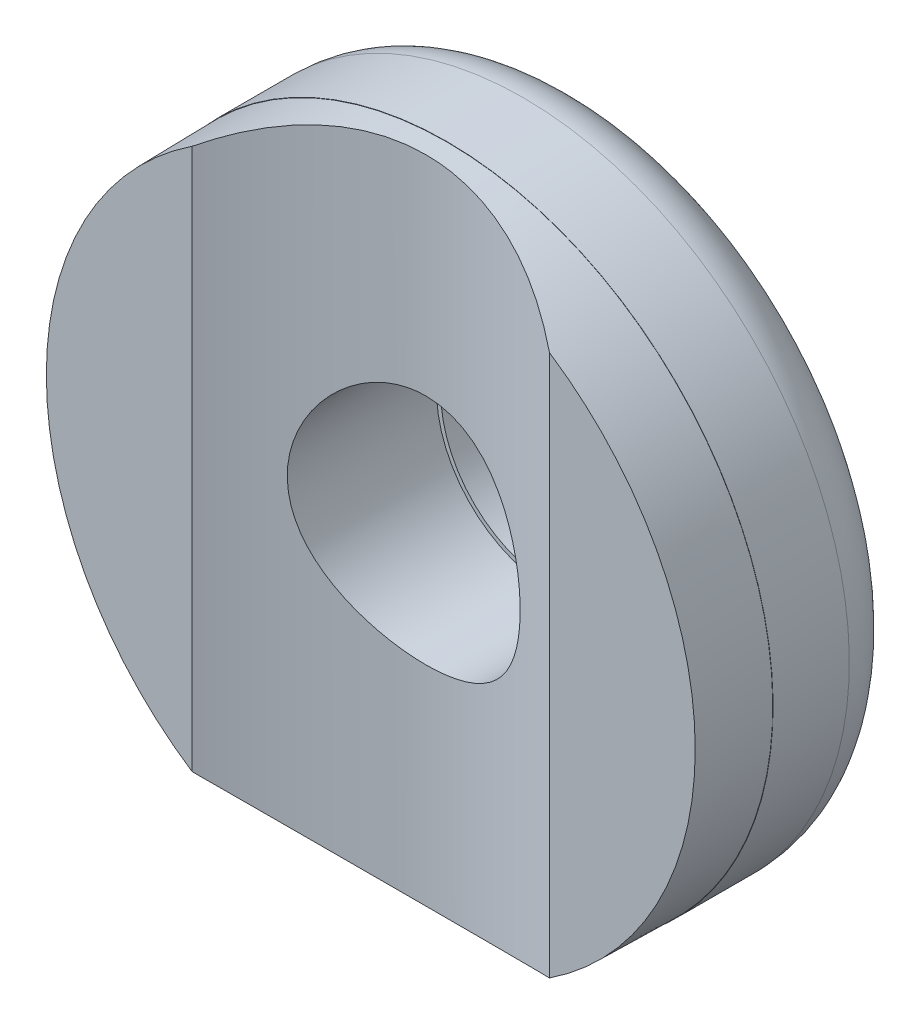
ISO-10303-21;
HEADER;
FILE_DESCRIPTION(('STEP AP214'),'2;1');
FILE_NAME('part.step','',(''),(''),'','','');
FILE_SCHEMA(('AUTOMOTIVE_DESIGN { 1 0 10303 214 1 1 1 1 }'));
ENDSEC;
DATA;
#1=APPLICATION_CONTEXT('core data for automotive mechanical design processes');
#2=APPLICATION_PROTOCOL_DEFINITION('international standard','automotive_design',2000,#1);
#3=PRODUCT_CONTEXT('',#1,'mechanical');
#4=PRODUCT('Part','Part','',(#3));
#5=PRODUCT_RELATED_PRODUCT_CATEGORY('part','',(#4));
#6=PRODUCT_DEFINITION_FORMATION('','',#4);
#7=PRODUCT_DEFINITION_CONTEXT('part definition',#1,'design');
#8=PRODUCT_DEFINITION('design','',#6,#7);
#9=PRODUCT_DEFINITION_SHAPE('','',#8);
#10=(LENGTH_UNIT() NAMED_UNIT(*) SI_UNIT(.MILLI.,.METRE.));
#11=(NAMED_UNIT(*) PLANE_ANGLE_UNIT() SI_UNIT($,.RADIAN.));
#12=(NAMED_UNIT(*) SI_UNIT($,.STERADIAN.) SOLID_ANGLE_UNIT());
#13=UNCERTAINTY_MEASURE_WITH_UNIT(LENGTH_MEASURE(1.E-05),#10,'distance_accuracy_value','');
#14=(GEOMETRIC_REPRESENTATION_CONTEXT(3) GLOBAL_UNCERTAINTY_ASSIGNED_CONTEXT((#13)) GLOBAL_UNIT_ASSIGNED_CONTEXT((#10,
#11,#12)) REPRESENTATION_CONTEXT('',''));
#15=CARTESIAN_POINT('',(0.,0.,0.));
#16=DIRECTION('',(0.,0.,1.));
#17=DIRECTION('',(1.,0.,0.));
#18=AXIS2_PLACEMENT_3D('',#15,#16,#17);
#19=CARTESIAN_POINT('',(6.3,0.,0.));
#20=DIRECTION('',(0.,0.,1.));
#21=DIRECTION('',(0.,-1.,0.));
#22=AXIS2_PLACEMENT_3D('',#19,#20,#21);
#23=PLANE('',#22);
#24=CARTESIAN_POINT('',(0.,0.,0.));
#25=DIRECTION('',(0.,0.,1.));
#26=DIRECTION('',(1.,0.,0.));
#27=AXIS2_PLACEMENT_3D('',#24,#25,#26);
#28=CIRCLE('',#27,2.65);
#29=CARTESIAN_POINT('',(2.65,0.,0.));
#30=VERTEX_POINT('',#29);
#31=EDGE_CURVE('E86',#30,#30,#28,.T.);
#32=ORIENTED_EDGE('',*,*,#31,.T.);
#33=EDGE_LOOP('',(#32));
#34=FACE_BOUND('',#33,.T.);
#35=CARTESIAN_POINT('',(0.,0.,0.));
#36=DIRECTION('',(0.,0.,-1.));
#37=DIRECTION('',(0.,1.,0.));
#38=AXIS2_PLACEMENT_3D('',#35,#36,#37);
#39=CIRCLE('',#38,6.3);
#40=CARTESIAN_POINT('',(0.,6.3,0.));
#41=VERTEX_POINT('',#40);
#42=EDGE_CURVE('E93',#41,#41,#39,.T.);
#43=ORIENTED_EDGE('',*,*,#42,.T.);
#44=EDGE_LOOP('',(#43));
#45=FACE_BOUND('',#44,.T.);
#46=ADVANCED_FACE('F14',(#34,#45),#23,.F.);
#47=CARTESIAN_POINT('',(0.,0.,1.4));
#48=DIRECTION('',(0.,0.,-1.));
#49=DIRECTION('',(0.,1.,0.));
#50=AXIS2_PLACEMENT_3D('',#47,#48,#49);
#51=TOROIDAL_SURFACE('',#50,6.3,1.4);
#52=CARTESIAN_POINT('',(0.,0.,1.4));
#53=DIRECTION('',(0.,0.,-1.));
#54=DIRECTION('',(0.,1.,0.));
#55=AXIS2_PLACEMENT_3D('',#52,#53,#54);
#56=CIRCLE('',#55,7.7);
#57=CARTESIAN_POINT('',(0.,7.7,1.4));
#58=VERTEX_POINT('',#57);
#59=EDGE_CURVE('E95',#58,#58,#56,.T.);
#60=ORIENTED_EDGE('',*,*,#59,.T.);
#61=EDGE_LOOP('',(#60));
#62=FACE_BOUND('',#61,.T.);
#63=ORIENTED_EDGE('',*,*,#42,.F.);
#64=EDGE_LOOP('',(#63));
#65=FACE_BOUND('',#64,.T.);
#66=ADVANCED_FACE('F131',(#62,#65),#51,.T.);
#67=CARTESIAN_POINT('',(0.,0.,0.));
#68=DIRECTION('',(0.,0.,-1.));
#69=DIRECTION('',(0.,1.,0.));
#70=AXIS2_PLACEMENT_3D('',#67,#68,#69);
#71=CYLINDRICAL_SURFACE('',#70,7.7);
#72=ORIENTED_EDGE('',*,*,#59,.F.);
#73=EDGE_LOOP('',(#72));
#74=FACE_BOUND('',#73,.T.);
#75=CARTESIAN_POINT('',(0.,0.,3.2));
#76=DIRECTION('',(0.,0.,-1.));
#77=DIRECTION('',(0.,1.,0.));
#78=AXIS2_PLACEMENT_3D('',#75,#76,#77);
#79=CIRCLE('',#78,7.7);
#80=CARTESIAN_POINT('',(0.,7.7,3.2));
#81=VERTEX_POINT('',#80);
#82=EDGE_CURVE('E18',#81,#81,#79,.T.);
#83=ORIENTED_EDGE('',*,*,#82,.T.);
#84=EDGE_LOOP('',(#83));
#85=FACE_BOUND('',#84,.T.);
#86=ADVANCED_FACE('F102',(#74,#85),#71,.T.);
#87=CARTESIAN_POINT('',(7.,0.,3.2));
#88=DIRECTION('',(0.,0.,-1.));
#89=DIRECTION('',(0.,1.,0.));
#90=AXIS2_PLACEMENT_3D('',#87,#88,#89);
#91=PLANE('',#90);
#92=ORIENTED_EDGE('',*,*,#82,.F.);
#93=EDGE_LOOP('',(#92));
#94=FACE_BOUND('',#93,.T.);
#95=CARTESIAN_POINT('',(0.,0.,3.2));
#96=DIRECTION('',(0.,0.,-1.));
#97=DIRECTION('',(0.,1.,0.));
#98=AXIS2_PLACEMENT_3D('',#95,#96,#97);
#99=CIRCLE('',#98,7.69301797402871);
#100=CARTESIAN_POINT('',(0.,7.69301797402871,3.2));
#101=VERTEX_POINT('',#100);
#102=EDGE_CURVE('E9',#101,#101,#99,.T.);
#103=ORIENTED_EDGE('',*,*,#102,.T.);
#104=EDGE_LOOP('',(#103));
#105=FACE_BOUND('',#104,.T.);
#106=ADVANCED_FACE('F104',(#94,#105),#91,.F.);
#107=CARTESIAN_POINT('',(0.,0.,3.2));
#108=DIRECTION('',(0.,0.,-1.));
#109=DIRECTION('',(0.,1.,0.));
#110=AXIS2_PLACEMENT_3D('',#107,#108,#109);
#111=CYLINDRICAL_SURFACE('',#110,2.65);
#112=ORIENTED_EDGE('',*,*,#31,.F.);
#113=EDGE_LOOP('',(#112));
#114=FACE_BOUND('',#113,.T.);
#115=CARTESIAN_POINT('',(0.,0.,0.7));
#116=DIRECTION('',(0.,0.,-1.));
#117=DIRECTION('',(0.,1.,0.));
#118=AXIS2_PLACEMENT_3D('',#115,#116,#117);
#119=CIRCLE('',#118,2.65);
#120=CARTESIAN_POINT('',(0.,2.65,0.7));
#121=VERTEX_POINT('',#120);
#122=EDGE_CURVE('E89',#121,#121,#119,.F.);
#123=ORIENTED_EDGE('',*,*,#122,.T.);
#124=EDGE_LOOP('',(#123));
#125=FACE_BOUND('',#124,.T.);
#126=ADVANCED_FACE('F107',(#114,#125),#111,.F.);
#127=CARTESIAN_POINT('',(0.,0.,0.7));
#128=DIRECTION('',(0.,0.,-1.));
#129=DIRECTION('',(0.,1.,0.));
#130=AXIS2_PLACEMENT_3D('',#127,#128,#129);
#131=PLANE('',#130);
#132=CARTESIAN_POINT('',(0.,0.,0.7));
#133=DIRECTION('',(0.,0.,-1.));
#134=DIRECTION('',(0.,1.,0.));
#135=AXIS2_PLACEMENT_3D('',#132,#133,#134);
#136=CIRCLE('',#135,2.75);
#137=CARTESIAN_POINT('',(0.,2.75,0.7));
#138=VERTEX_POINT('',#137);
#139=EDGE_CURVE('E90',#138,#138,#136,.F.);
#140=ORIENTED_EDGE('',*,*,#139,.T.);
#141=EDGE_LOOP('',(#140));
#142=FACE_BOUND('',#141,.T.);
#143=ORIENTED_EDGE('',*,*,#122,.F.);
#144=EDGE_LOOP('',(#143));
#145=FACE_BOUND('',#144,.T.);
#146=ADVANCED_FACE('F16',(#142,#145),#131,.F.);
#147=CARTESIAN_POINT('',(0.,0.,5.));
#148=DIRECTION('',(0.,0.,-1.));
#149=DIRECTION('',(0.,1.,0.));
#150=AXIS2_PLACEMENT_3D('',#147,#148,#149);
#151=PLANE('',#150);
#152=CARTESIAN_POINT('',(0.,0.,5.));
#153=DIRECTION('',(0.,0.,-1.));
#154=DIRECTION('',(0.,1.,0.));
#155=AXIS2_PLACEMENT_3D('',#152,#153,#154);
#156=CIRCLE('',#155,7.66159885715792);
#157=CARTESIAN_POINT('',(4.22018956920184,6.39453649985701,5.));
#158=VERTEX_POINT('',#157);
#159=CARTESIAN_POINT('',(4.22018956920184,-6.39453649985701,5.));
#160=VERTEX_POINT('',#159);
#161=EDGE_CURVE('E48',#158,#160,#156,.T.);
#162=ORIENTED_EDGE('',*,*,#161,.F.);
#163=DIRECTION('',(0.,1.,0.));
#164=VECTOR('',#163,1.);
#165=CARTESIAN_POINT('',(4.22018956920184,-7.7,5.));
#166=LINE('',#165,#164);
#167=EDGE_CURVE('E31',#160,#158,#166,.T.);
#168=ORIENTED_EDGE('',*,*,#167,.F.);
#169=EDGE_LOOP('',(#162,#168));
#170=FACE_BOUND('',#169,.T.);
#171=ADVANCED_FACE('F116',(#170),#151,.F.);
#172=DIRECTION('',(0.,1.,0.));
#173=VECTOR('',#172,1.);
#174=CARTESIAN_POINT('',(-4.22018956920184,-7.7,5.));
#175=LINE('',#174,#173);
#176=CARTESIAN_POINT('',(-4.22018956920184,6.39453649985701,5.));
#177=VERTEX_POINT('',#176);
#178=CARTESIAN_POINT('',(-4.22018956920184,-6.39453649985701,5.));
#179=VERTEX_POINT('',#178);
#180=EDGE_CURVE('E36',#177,#179,#175,.F.);
#181=ORIENTED_EDGE('',*,*,#180,.F.);
#182=EDGE_CURVE('E53',#179,#177,#156,.T.);
#183=ORIENTED_EDGE('',*,*,#182,.F.);
#184=EDGE_LOOP('',(#181,#183));
#185=FACE_BOUND('',#184,.T.);
#186=ADVANCED_FACE('F52',(#185),#151,.F.);
#187=CARTESIAN_POINT('',(0.,-7.7,11.2));
#188=DIRECTION('',(0.,1.,0.));
#189=DIRECTION('',(-1.,0.,0.));
#190=AXIS2_PLACEMENT_3D('',#187,#188,#189);
#191=CYLINDRICAL_SURFACE('',#190,7.5);
#192=CARTESIAN_POINT('',(-4.22048337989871,-6.39433840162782,5.0002000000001));
#193=CARTESIAN_POINT('',(-4.09185215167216,-6.48107504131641,4.91263113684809));
#194=CARTESIAN_POINT('',(-3.95906178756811,-6.56483854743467,4.82809791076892));
#195=CARTESIAN_POINT('',(-3.68522126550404,-6.72561223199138,4.66589819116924));
#196=CARTESIAN_POINT('',(-3.54416269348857,-6.80261532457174,4.58823890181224));
#197=CARTESIAN_POINT('',(-3.25292487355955,-6.94947612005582,4.44016424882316));
#198=CARTESIAN_POINT('',(-3.10268043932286,-7.01927019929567,4.36981335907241));
#199=CARTESIAN_POINT('',(-2.79460166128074,-7.14998264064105,4.2380851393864));
#200=CARTESIAN_POINT('',(-2.6367687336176,-7.21090265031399,4.17670614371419));
#201=CARTESIAN_POINT('',(-2.31305444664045,-7.32326223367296,4.06351801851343));
#202=CARTESIAN_POINT('',(-2.14712515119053,-7.3746336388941,4.01177769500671));
#203=CARTESIAN_POINT('',(-1.80931755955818,-7.46635465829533,3.91940890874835));
#204=CARTESIAN_POINT('',(-1.63744268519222,-7.50671049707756,3.878774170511));
#205=CARTESIAN_POINT('',(-1.28956623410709,-7.57543845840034,3.80957673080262));
#206=CARTESIAN_POINT('',(-1.11358133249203,-7.60385230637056,3.78097199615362));
#207=CARTESIAN_POINT('',(-0.758482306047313,-7.64822092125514,3.73630722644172));
#208=CARTESIAN_POINT('',(-0.579368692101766,-7.66417770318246,3.72024516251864));
#209=CARTESIAN_POINT('',(-0.240292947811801,-7.68215197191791,3.7021524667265));
#210=CARTESIAN_POINT('',(-0.0804757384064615,-7.68555136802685,3.69873078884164));
#211=CARTESIAN_POINT('',(0.238941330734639,-7.6821979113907,3.70210627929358));
#212=CARTESIAN_POINT('',(0.398541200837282,-7.67544556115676,3.70890294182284));
#213=CARTESIAN_POINT('',(0.716337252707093,-7.65191772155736,3.73258623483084));
#214=CARTESIAN_POINT('',(0.874532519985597,-7.63513612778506,3.74947901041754));
#215=CARTESIAN_POINT('',(1.18821873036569,-7.59187550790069,3.79302936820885));
#216=CARTESIAN_POINT('',(1.34370969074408,-7.56539654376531,3.81968688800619));
#217=CARTESIAN_POINT('',(1.64273552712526,-7.50488563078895,3.88061192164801));
#218=CARTESIAN_POINT('',(1.7864659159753,-7.47133151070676,3.91439806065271));
#219=CARTESIAN_POINT('',(2.06982106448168,-7.3964830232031,3.98977320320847));
#220=CARTESIAN_POINT('',(2.20944437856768,-7.35518596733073,4.03136491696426));
#221=CARTESIAN_POINT('',(2.62129166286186,-7.22047149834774,4.16706053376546));
#222=CARTESIAN_POINT('',(2.88653113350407,-7.11622285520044,4.272092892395));
#223=CARTESIAN_POINT('',(3.33421729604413,-6.91145621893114,4.47849056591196));
#224=CARTESIAN_POINT('',(3.52138773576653,-6.81590950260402,4.57482550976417));
#225=CARTESIAN_POINT('',(3.88146350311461,-6.61330758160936,4.77918679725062));
#226=CARTESIAN_POINT('',(4.05442327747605,-6.50630030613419,4.88716446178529));
#227=CARTESIAN_POINT('',(4.22048337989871,-6.39433840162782,5.0002000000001));
#228=B_SPLINE_CURVE_WITH_KNOTS('',3,(#192,#193,#194,#195,#196,#197,#198,#199,#200,#201,#202,
#203,#204,#205,#206,#207,#208,#209,#210,#211,#212,#213,#214,#215,#216,#217,#218,#219,#220,#221,
#222,#223,#224,#225,#226,#227),.UNSPECIFIED.,.F.,.F.,(4,2,2,2,2,2,2,2,2,2,2,2,2,2,2,2,2,4),(0.,
0.534446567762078,1.06944678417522,1.60882469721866,2.14810234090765,2.69109332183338,
3.23377683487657,3.77454811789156,4.31523190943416,4.79426704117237,5.27327846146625,
5.75258173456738,6.23188194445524,6.68563402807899,7.13954395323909,8.04724566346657,
8.73982407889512,9.42961150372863),.UNSPECIFIED.);
#229=EDGE_CURVE('E23',#179,#160,#228,.T.);
#230=ORIENTED_EDGE('',*,*,#229,.T.);
#231=ORIENTED_EDGE('',*,*,#167,.T.);
#232=CARTESIAN_POINT('',(4.22048337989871,6.39433840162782,5.0002000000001));
#233=CARTESIAN_POINT('',(4.09185215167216,6.48107504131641,4.91263113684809));
#234=CARTESIAN_POINT('',(3.95906178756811,6.56483854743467,4.82809791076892));
#235=CARTESIAN_POINT('',(3.68522126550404,6.72561223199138,4.66589819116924));
#236=CARTESIAN_POINT('',(3.54416269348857,6.80261532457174,4.58823890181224));
#237=CARTESIAN_POINT('',(3.25292487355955,6.94947612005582,4.44016424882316));
#238=CARTESIAN_POINT('',(3.10268043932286,7.01927019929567,4.36981335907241));
#239=CARTESIAN_POINT('',(2.79460166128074,7.14998264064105,4.2380851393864));
#240=CARTESIAN_POINT('',(2.6367687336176,7.21090265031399,4.17670614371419));
#241=CARTESIAN_POINT('',(2.31305444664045,7.32326223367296,4.06351801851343));
#242=CARTESIAN_POINT('',(2.14712515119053,7.3746336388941,4.01177769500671));
#243=CARTESIAN_POINT('',(1.80931755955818,7.46635465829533,3.91940890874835));
#244=CARTESIAN_POINT('',(1.63744268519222,7.50671049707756,3.878774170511));
#245=CARTESIAN_POINT('',(1.28956623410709,7.57543845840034,3.80957673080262));
#246=CARTESIAN_POINT('',(1.11358133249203,7.60385230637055,3.78097199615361));
#247=CARTESIAN_POINT('',(0.758482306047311,7.64822092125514,3.73630722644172));
#248=CARTESIAN_POINT('',(0.579368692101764,7.66417770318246,3.72024516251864));
#249=CARTESIAN_POINT('',(0.240292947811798,7.68215197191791,3.7021524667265));
#250=CARTESIAN_POINT('',(0.0804757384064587,7.68555136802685,3.69873078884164));
#251=CARTESIAN_POINT('',(-0.238941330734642,7.6821979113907,3.70210627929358));
#252=CARTESIAN_POINT('',(-0.398541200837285,7.67544556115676,3.70890294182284));
#253=CARTESIAN_POINT('',(-0.716337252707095,7.65191772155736,3.73258623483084));
#254=CARTESIAN_POINT('',(-0.874532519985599,7.63513612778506,3.74947901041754));
#255=CARTESIAN_POINT('',(-1.1882187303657,7.59187550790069,3.79302936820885));
#256=CARTESIAN_POINT('',(-1.34370969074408,7.56539654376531,3.81968688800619));
#257=CARTESIAN_POINT('',(-1.64273552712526,7.50488563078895,3.88061192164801));
#258=CARTESIAN_POINT('',(-1.7864659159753,7.47133151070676,3.91439806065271));
#259=CARTESIAN_POINT('',(-2.06982106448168,7.3964830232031,3.98977320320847));
#260=CARTESIAN_POINT('',(-2.20944437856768,7.35518596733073,4.03136491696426));
#261=CARTESIAN_POINT('',(-2.62129166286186,7.22047149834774,4.16706053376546));
#262=CARTESIAN_POINT('',(-2.88653113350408,7.11622285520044,4.272092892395));
#263=CARTESIAN_POINT('',(-3.33421729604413,6.91145621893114,4.47849056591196));
#264=CARTESIAN_POINT('',(-3.52138773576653,6.81590950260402,4.57482550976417));
#265=CARTESIAN_POINT('',(-3.88146350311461,6.61330758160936,4.77918679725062));
#266=CARTESIAN_POINT('',(-4.05442327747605,6.50630030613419,4.8871644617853));
#267=CARTESIAN_POINT('',(-4.22048337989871,6.39433840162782,5.0002000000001));
#268=B_SPLINE_CURVE_WITH_KNOTS('',3,(#232,#233,#234,#235,#236,#237,#238,#239,#240,#241,#242,
#243,#244,#245,#246,#247,#248,#249,#250,#251,#252,#253,#254,#255,#256,#257,#258,#259,#260,#261,
#262,#263,#264,#265,#266,#267),.UNSPECIFIED.,.F.,.F.,(4,2,2,2,2,2,2,2,2,2,2,2,2,2,2,2,2,4),(0.,
0.534446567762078,1.06944678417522,1.60882469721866,2.14810234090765,2.69109332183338,
3.23377683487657,3.77454811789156,4.31523190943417,4.79426704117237,5.27327846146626,
5.75258173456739,6.23188194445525,6.68563402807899,7.1395439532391,8.04724566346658,
8.73982407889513,9.42961150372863),.UNSPECIFIED.);
#269=EDGE_CURVE('E42',#158,#177,#268,.T.);
#270=ORIENTED_EDGE('',*,*,#269,.T.);
#271=ORIENTED_EDGE('',*,*,#180,.T.);
#272=EDGE_LOOP('',(#230,#231,#270,#271));
#273=FACE_BOUND('',#272,.T.);
#274=CARTESIAN_POINT('',(0.,2.75,3.7));
#275=CARTESIAN_POINT('',(0.149163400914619,2.75000423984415,3.69999687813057));
#276=CARTESIAN_POINT('',(0.29829715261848,2.73782548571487,3.70448916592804));
#277=CARTESIAN_POINT('',(0.592120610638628,2.68961923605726,3.72196228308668));
#278=CARTESIAN_POINT('',(0.736810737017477,2.65359400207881,3.7349423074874));
#279=CARTESIAN_POINT('',(1.01746784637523,2.55913145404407,3.76799400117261));
#280=CARTESIAN_POINT('',(1.15345064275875,2.5007361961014,3.78805235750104));
#281=CARTESIAN_POINT('',(1.41368339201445,2.36340019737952,3.83325274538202));
#282=CARTESIAN_POINT('',(1.53793033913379,2.28445421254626,3.85839607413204));
#283=CARTESIAN_POINT('',(1.7762429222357,2.10488341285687,3.91230879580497));
#284=CARTESIAN_POINT('',(1.88976472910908,2.00356699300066,3.94117766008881));
#285=CARTESIAN_POINT('',(2.09863947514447,1.78359974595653,3.99878665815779));
#286=CARTESIAN_POINT('',(2.19398720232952,1.664943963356,4.02752675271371));
#287=CARTESIAN_POINT('',(2.36719005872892,1.40844037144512,4.08276807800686));
#288=CARTESIAN_POINT('',(2.44428985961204,1.27005454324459,4.10915110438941));
#289=CARTESIAN_POINT('',(2.5738807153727,0.981159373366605,4.15515067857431));
#290=CARTESIAN_POINT('',(2.626381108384,0.830654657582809,4.17476979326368));
#291=CARTESIAN_POINT('',(2.70315787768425,0.528041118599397,4.20396009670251));
#292=CARTESIAN_POINT('',(2.72846856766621,0.376231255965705,4.21389805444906));
#293=CARTESIAN_POINT('',(2.75338169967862,0.0702188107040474,4.22367673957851));
#294=CARTESIAN_POINT('',(2.7529941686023,-0.083982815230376,4.22352140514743));
#295=CARTESIAN_POINT('',(2.72731524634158,-0.381078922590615,4.21344838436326));
#296=CARTESIAN_POINT('',(2.70343999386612,-0.5241180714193,4.20408583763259));
#297=CARTESIAN_POINT('',(2.63379801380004,-0.803997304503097,4.17757294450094));
#298=CARTESIAN_POINT('',(2.58802813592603,-0.940836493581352,4.16042147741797));
#299=CARTESIAN_POINT('',(2.47508832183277,-1.20738579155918,4.11991662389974));
#300=CARTESIAN_POINT('',(2.40754043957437,-1.33691859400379,4.09645501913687));
#301=CARTESIAN_POINT('',(2.25322516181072,-1.58322935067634,4.04601139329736));
#302=CARTESIAN_POINT('',(2.16645134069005,-1.70000302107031,4.01902819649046));
#303=CARTESIAN_POINT('',(1.96960155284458,-1.92534548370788,3.96247312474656));
#304=CARTESIAN_POINT('',(1.85838932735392,-2.032910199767,3.93284612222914));
#305=CARTESIAN_POINT('',(1.61915779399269,-2.22815375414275,3.87583227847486));
#306=CARTESIAN_POINT('',(1.49113612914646,-2.31582979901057,3.8484457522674));
#307=CARTESIAN_POINT('',(1.21944943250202,-2.46984992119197,3.79849595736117));
#308=CARTESIAN_POINT('',(1.07558804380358,-2.53587333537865,3.77600671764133));
#309=CARTESIAN_POINT('',(0.777771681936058,-2.64245243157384,3.73893171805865));
#310=CARTESIAN_POINT('',(0.623821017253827,-2.68301890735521,3.72434260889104));
#311=CARTESIAN_POINT('',(0.318657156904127,-2.73563410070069,3.70529338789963));
#312=CARTESIAN_POINT('',(0.167706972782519,-2.74903583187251,3.70035318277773));
#313=CARTESIAN_POINT('',(-0.134347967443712,-2.75086300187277,3.69968391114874));
#314=CARTESIAN_POINT('',(-0.28545268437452,-2.73929369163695,3.70395290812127));
#315=CARTESIAN_POINT('',(-0.577771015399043,-2.69254520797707,3.72090528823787));
#316=CARTESIAN_POINT('',(-0.719144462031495,-2.65824067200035,3.73327676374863));
#317=CARTESIAN_POINT('',(-0.994039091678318,-2.5681349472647,3.76487764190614));
#318=CARTESIAN_POINT('',(-1.12755925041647,-2.51233096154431,3.78410793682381));
#319=CARTESIAN_POINT('',(-1.38727106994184,-2.37905391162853,3.8282065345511));
#320=CARTESIAN_POINT('',(-1.51313995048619,-2.30100186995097,3.85322155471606));
#321=CARTESIAN_POINT('',(-1.75040675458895,-2.12610360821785,3.90610691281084));
#322=CARTESIAN_POINT('',(-1.86179948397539,-2.02925067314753,3.93397826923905));
#323=CARTESIAN_POINT('',(-2.073402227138,-1.81317737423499,3.99141556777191));
#324=CARTESIAN_POINT('',(-2.17265048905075,-1.69301494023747,4.02098982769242));
#325=CARTESIAN_POINT('',(-2.34974917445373,-1.43714500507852,4.07698579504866));
#326=CARTESIAN_POINT('',(-2.42759811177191,-1.30143642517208,4.10340728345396));
#327=CARTESIAN_POINT('',(-2.55965637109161,-1.01746262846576,4.14995732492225));
#328=CARTESIAN_POINT('',(-2.61380312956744,-0.869165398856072,4.17006918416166));
#329=CARTESIAN_POINT('',(-2.69602324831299,-0.564621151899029,4.20118376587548));
#330=CARTESIAN_POINT('',(-2.72411178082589,-0.408378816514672,4.21219178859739));
#331=CARTESIAN_POINT('',(-2.75209516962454,-0.102748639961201,4.22316860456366));
#332=CARTESIAN_POINT('',(-2.75362072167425,0.046468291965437,4.22377585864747));
#333=CARTESIAN_POINT('',(-2.73257863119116,0.342911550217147,4.21550723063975));
#334=CARTESIAN_POINT('',(-2.710013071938,0.490138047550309,4.20663216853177));
#335=CARTESIAN_POINT('',(-2.64267697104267,0.77426908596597,4.18091936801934));
#336=CARTESIAN_POINT('',(-2.59854310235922,0.911346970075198,4.16431054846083));
#337=CARTESIAN_POINT('',(-2.48987356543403,1.1762391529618,4.1251254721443));
#338=CARTESIAN_POINT('',(-2.42533285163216,1.30405115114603,4.10254773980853));
#339=CARTESIAN_POINT('',(-2.2738785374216,1.553826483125,4.05254348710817));
#340=CARTESIAN_POINT('',(-2.18599626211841,1.67516442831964,4.02492912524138));
#341=CARTESIAN_POINT('',(-1.99188099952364,1.90189324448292,3.96863684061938));
#342=CARTESIAN_POINT('',(-1.88564231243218,2.0072791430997,3.93995858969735));
#343=CARTESIAN_POINT('',(-1.65137159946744,2.20455997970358,3.88301958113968));
#344=CARTESIAN_POINT('',(-1.52250654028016,2.29549740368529,3.85485406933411));
#345=CARTESIAN_POINT('',(-1.25034215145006,2.45437734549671,3.80366330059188));
#346=CARTESIAN_POINT('',(-1.10704276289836,2.52231976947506,3.78063806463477));
#347=CARTESIAN_POINT('',(-0.806234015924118,2.63416997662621,3.74188285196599));
#348=CARTESIAN_POINT('',(-0.648460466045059,2.6774402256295,3.7263478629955));
#349=CARTESIAN_POINT('',(-0.32711098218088,2.73534652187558,3.70541040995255));
#350=CARTESIAN_POINT('',(-0.163537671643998,2.7499953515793,3.7000034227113));
#351=CARTESIAN_POINT('',(0.,2.75,3.7));
#352=B_SPLINE_CURVE_WITH_KNOTS('',3,(#274,#275,#276,#277,#278,#279,#280,#281,#282,#283,#284,
#285,#286,#287,#288,#289,#290,#291,#292,#293,#294,#295,#296,#297,#298,#299,#300,#301,#302,#303,
#304,#305,#306,#307,#308,#309,#310,#311,#312,#313,#314,#315,#316,#317,#318,#319,#320,#321,#322,
#323,#324,#325,#326,#327,#328,#329,#330,#331,#332,#333,#334,#335,#336,#337,#338,#339,#340,#341,
#342,#343,#344,#345,#346,#347,#348,#349,#350,#351),.UNSPECIFIED.,.T.,.F.,(4,2,2,2,2,2,2,2,2,2,2,
2,2,2,2,2,2,2,2,2,2,2,2,2,2,2,2,2,2,2,2,2,2,2,2,2,2,2,4),(0.,0.446887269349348,0.89373216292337,
1.33974106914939,1.7858638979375,2.24842473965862,2.71111803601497,3.19050672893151,
3.6697132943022,4.12996375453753,4.59003463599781,5.02396705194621,5.45796192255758,
5.89993527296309,6.34205656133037,6.81248619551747,7.28298186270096,7.7601599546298,
8.2371355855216,8.68970480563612,9.14217886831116,9.57818454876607,10.0142469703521,
10.462896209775,10.9117059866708,11.385386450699,11.8590998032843,12.3340561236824,
12.80873572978,13.254164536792,13.6995548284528,14.13252653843,14.5656053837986,15.020648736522,
15.4758336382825,15.9541458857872,16.4324600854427,16.9226310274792,17.4125830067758),.UNSPECIFIED.);
#353=CARTESIAN_POINT('',(0.,2.75,3.7));
#354=VERTEX_POINT('',#353);
#355=EDGE_CURVE('E80',#354,#354,#352,.T.);
#356=ORIENTED_EDGE('',*,*,#355,.T.);
#357=EDGE_LOOP('',(#356));
#358=FACE_BOUND('',#357,.T.);
#359=ADVANCED_FACE('F43',(#273,#358),#191,.F.);
#360=CARTESIAN_POINT('',(0.,0.,5.));
#361=DIRECTION('',(0.,0.,-1.));
#362=DIRECTION('',(0.,1.,0.));
#363=AXIS2_PLACEMENT_3D('',#360,#361,#362);
#364=CONICAL_SURFACE('',#363,7.66159885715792,0.0174532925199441);
#365=ORIENTED_EDGE('',*,*,#229,.F.);
#366=ORIENTED_EDGE('',*,*,#182,.T.);
#367=ORIENTED_EDGE('',*,*,#269,.F.);
#368=ORIENTED_EDGE('',*,*,#161,.T.);
#369=EDGE_LOOP('',(#365,#366,#367,#368));
#370=FACE_BOUND('',#369,.T.);
#371=ORIENTED_EDGE('',*,*,#102,.F.);
#372=EDGE_LOOP('',(#371));
#373=FACE_BOUND('',#372,.T.);
#374=ADVANCED_FACE('F55',(#370,#373),#364,.T.);
#375=CARTESIAN_POINT('',(0.,0.,5.));
#376=DIRECTION('',(0.,0.,-1.));
#377=DIRECTION('',(0.,1.,0.));
#378=AXIS2_PLACEMENT_3D('',#375,#376,#377);
#379=CYLINDRICAL_SURFACE('',#378,2.75);
#380=ORIENTED_EDGE('',*,*,#355,.F.);
#381=EDGE_LOOP('',(#380));
#382=FACE_BOUND('',#381,.T.);
#383=ORIENTED_EDGE('',*,*,#139,.F.);
#384=EDGE_LOOP('',(#383));
#385=FACE_BOUND('',#384,.T.);
#386=ADVANCED_FACE('F76',(#382,#385),#379,.F.);
#387=CLOSED_SHELL('',(#46,#66,#86,#106,#126,#146,#171,#186,#359,#374,#386));
#388=MANIFOLD_SOLID_BREP('B1',#387);
#389=ADVANCED_BREP_SHAPE_REPRESENTATION('',(#18,#388),#14);
#390=SHAPE_DEFINITION_REPRESENTATION(#9,#389);
ENDSEC;
END-ISO-10303-21;
